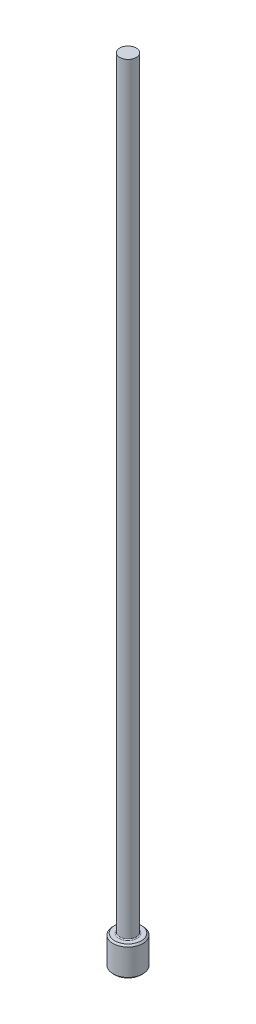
ISO-10303-21;
HEADER;
FILE_DESCRIPTION(('STEP AP214'),'2;1');
FILE_NAME('part.step','',(''),(''),'','','');
FILE_SCHEMA(('AUTOMOTIVE_DESIGN { 1 0 10303 214 1 1 1 1 }'));
ENDSEC;
DATA;
#1=APPLICATION_CONTEXT('core data for automotive mechanical design processes');
#2=APPLICATION_PROTOCOL_DEFINITION('international standard','automotive_design',2000,#1);
#3=PRODUCT_CONTEXT('',#1,'mechanical');
#4=PRODUCT('Part','Part','',(#3));
#5=PRODUCT_RELATED_PRODUCT_CATEGORY('part','',(#4));
#6=PRODUCT_DEFINITION_FORMATION('','',#4);
#7=PRODUCT_DEFINITION_CONTEXT('part definition',#1,'design');
#8=PRODUCT_DEFINITION('design','',#6,#7);
#9=PRODUCT_DEFINITION_SHAPE('','',#8);
#10=(LENGTH_UNIT() NAMED_UNIT(*) SI_UNIT(.MILLI.,.METRE.));
#11=(NAMED_UNIT(*) PLANE_ANGLE_UNIT() SI_UNIT($,.RADIAN.));
#12=(NAMED_UNIT(*) SI_UNIT($,.STERADIAN.) SOLID_ANGLE_UNIT());
#13=UNCERTAINTY_MEASURE_WITH_UNIT(LENGTH_MEASURE(1.E-05),#10,'distance_accuracy_value','');
#14=(GEOMETRIC_REPRESENTATION_CONTEXT(3) GLOBAL_UNCERTAINTY_ASSIGNED_CONTEXT((#13)) GLOBAL_UNIT_ASSIGNED_CONTEXT((#10,
#11,#12)) REPRESENTATION_CONTEXT('',''));
#15=CARTESIAN_POINT('',(0.,0.,0.));
#16=DIRECTION('',(0.,0.,1.));
#17=DIRECTION('',(1.,0.,0.));
#18=AXIS2_PLACEMENT_3D('',#15,#16,#17);
#19=CARTESIAN_POINT('',(0.,0.,0.));
#20=DIRECTION('',(0.,-1.,0.));
#21=DIRECTION('',(0.,0.,-1.));
#22=AXIS2_PLACEMENT_3D('',#19,#20,#21);
#23=PLANE('',#22);
#24=CARTESIAN_POINT('',(0.,0.,0.));
#25=DIRECTION('',(0.,-1.,0.));
#26=DIRECTION('',(0.,0.,-1.));
#27=AXIS2_PLACEMENT_3D('',#24,#25,#26);
#28=CIRCLE('',#27,1.06679999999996);
#29=CARTESIAN_POINT('',(0.,0.,-1.06679999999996));
#30=VERTEX_POINT('',#29);
#31=EDGE_CURVE('E46',#30,#30,#28,.T.);
#32=ORIENTED_EDGE('',*,*,#31,.T.);
#33=EDGE_LOOP('',(#32));
#34=FACE_BOUND('',#33,.T.);
#35=ADVANCED_FACE('F35',(#34),#23,.T.);
#36=CARTESIAN_POINT('',(0.,259.958771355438,0.));
#37=DIRECTION('',(0.,1.,0.));
#38=DIRECTION('',(0.,0.,1.));
#39=AXIS2_PLACEMENT_3D('',#36,#37,#38);
#40=CYLINDRICAL_SURFACE('',#39,1.19379999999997);
#41=CARTESIAN_POINT('',(0.,2.23519999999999,0.));
#42=DIRECTION('',(0.,1.,0.));
#43=DIRECTION('',(0.,0.,1.));
#44=AXIS2_PLACEMENT_3D('',#41,#42,#43);
#45=CIRCLE('',#44,1.19379999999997);
#46=CARTESIAN_POINT('',(0.,2.23519999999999,1.19379999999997));
#47=VERTEX_POINT('',#46);
#48=EDGE_CURVE('E50',#47,#47,#45,.F.);
#49=ORIENTED_EDGE('',*,*,#48,.T.);
#50=EDGE_LOOP('',(#49));
#51=FACE_BOUND('',#50,.T.);
#52=CARTESIAN_POINT('',(0.,0.126999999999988,0.));
#53=DIRECTION('',(0.,-1.,0.));
#54=DIRECTION('',(0.,0.,-1.));
#55=AXIS2_PLACEMENT_3D('',#52,#53,#54);
#56=CIRCLE('',#55,1.19379999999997);
#57=CARTESIAN_POINT('',(0.,0.126999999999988,-1.19379999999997));
#58=VERTEX_POINT('',#57);
#59=EDGE_CURVE('E55',#58,#58,#56,.F.);
#60=ORIENTED_EDGE('',*,*,#59,.T.);
#61=EDGE_LOOP('',(#60));
#62=FACE_BOUND('',#61,.T.);
#63=ADVANCED_FACE('F77',(#51,#62),#40,.T.);
#64=CARTESIAN_POINT('',(-1.19379999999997,2.3622,0.));
#65=DIRECTION('',(0.,1.,0.));
#66=DIRECTION('',(0.,0.,1.));
#67=AXIS2_PLACEMENT_3D('',#64,#65,#66);
#68=PLANE('',#67);
#69=CARTESIAN_POINT('',(0.,2.3622,0.));
#70=DIRECTION('',(0.,1.,0.));
#71=DIRECTION('',(0.,0.,1.));
#72=AXIS2_PLACEMENT_3D('',#69,#70,#71);
#73=CIRCLE('',#72,0.736599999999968);
#74=CARTESIAN_POINT('',(0.,2.3622,0.736599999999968));
#75=VERTEX_POINT('',#74);
#76=EDGE_CURVE('E10',#75,#75,#73,.F.);
#77=ORIENTED_EDGE('',*,*,#76,.T.);
#78=EDGE_LOOP('',(#77));
#79=FACE_BOUND('',#78,.T.);
#80=CARTESIAN_POINT('',(0.,2.3622,0.));
#81=DIRECTION('',(0.,1.,0.));
#82=DIRECTION('',(0.,0.,1.));
#83=AXIS2_PLACEMENT_3D('',#80,#81,#82);
#84=CIRCLE('',#83,1.06679999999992);
#85=CARTESIAN_POINT('',(0.,2.3622,1.06679999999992));
#86=VERTEX_POINT('',#85);
#87=EDGE_CURVE('E58',#86,#86,#84,.T.);
#88=ORIENTED_EDGE('',*,*,#87,.T.);
#89=EDGE_LOOP('',(#88));
#90=FACE_BOUND('',#89,.T.);
#91=ADVANCED_FACE('F69',(#79,#90),#68,.T.);
#92=CARTESIAN_POINT('',(0.,259.958771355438,0.));
#93=DIRECTION('',(0.,1.,0.));
#94=DIRECTION('',(0.,0.,1.));
#95=AXIS2_PLACEMENT_3D('',#92,#93,#94);
#96=CYLINDRICAL_SURFACE('',#95,0.660399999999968);
#97=CARTESIAN_POINT('',(0.,2.43840000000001,0.));
#98=DIRECTION('',(0.,1.,0.));
#99=DIRECTION('',(0.,0.,1.));
#100=AXIS2_PLACEMENT_3D('',#97,#98,#99);
#101=CIRCLE('',#100,0.660399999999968);
#102=CARTESIAN_POINT('',(0.,2.43840000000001,0.660399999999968));
#103=VERTEX_POINT('',#102);
#104=EDGE_CURVE('E42',#103,#103,#101,.T.);
#105=ORIENTED_EDGE('',*,*,#104,.T.);
#106=EDGE_LOOP('',(#105));
#107=FACE_BOUND('',#106,.T.);
#108=CARTESIAN_POINT('',(0.,63.5,0.));
#109=DIRECTION('',(0.,1.,0.));
#110=DIRECTION('',(0.,0.,1.));
#111=AXIS2_PLACEMENT_3D('',#108,#109,#110);
#112=CIRCLE('',#111,0.660399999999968);
#113=CARTESIAN_POINT('',(0.,63.5,0.660399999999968));
#114=VERTEX_POINT('',#113);
#115=EDGE_CURVE('E61',#114,#114,#112,.T.);
#116=ORIENTED_EDGE('',*,*,#115,.F.);
#117=EDGE_LOOP('',(#116));
#118=FACE_BOUND('',#117,.T.);
#119=ADVANCED_FACE('F67',(#107,#118),#96,.T.);
#120=CARTESIAN_POINT('',(-0.660399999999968,63.5,0.));
#121=DIRECTION('',(0.,1.,0.));
#122=DIRECTION('',(0.,0.,1.));
#123=AXIS2_PLACEMENT_3D('',#120,#121,#122);
#124=PLANE('',#123);
#125=ORIENTED_EDGE('',*,*,#115,.T.);
#126=EDGE_LOOP('',(#125));
#127=FACE_BOUND('',#126,.T.);
#128=ADVANCED_FACE('F65',(#127),#124,.T.);
#129=CARTESIAN_POINT('',(0.,2.36219999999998,0.));
#130=DIRECTION('',(0.,-1.,0.));
#131=DIRECTION('',(0.,0.,-1.));
#132=AXIS2_PLACEMENT_3D('',#129,#130,#131);
#133=CONICAL_SURFACE('',#132,1.06679999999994,0.785398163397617);
#134=ORIENTED_EDGE('',*,*,#48,.F.);
#135=EDGE_LOOP('',(#134));
#136=FACE_BOUND('',#135,.T.);
#137=ORIENTED_EDGE('',*,*,#87,.F.);
#138=EDGE_LOOP('',(#137));
#139=FACE_BOUND('',#138,.T.);
#140=ADVANCED_FACE('F75',(#136,#139),#133,.T.);
#141=CARTESIAN_POINT('',(0.,0.126999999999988,0.));
#142=DIRECTION('',(0.,1.,0.));
#143=DIRECTION('',(0.,0.,1.));
#144=AXIS2_PLACEMENT_3D('',#141,#142,#143);
#145=CONICAL_SURFACE('',#144,1.19379999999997,0.785398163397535);
#146=ORIENTED_EDGE('',*,*,#31,.F.);
#147=EDGE_LOOP('',(#146));
#148=FACE_BOUND('',#147,.T.);
#149=ORIENTED_EDGE('',*,*,#59,.F.);
#150=EDGE_LOOP('',(#149));
#151=FACE_BOUND('',#150,.T.);
#152=ADVANCED_FACE('F89',(#148,#151),#145,.T.);
#153=CARTESIAN_POINT('',(0.,2.43840000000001,0.));
#154=DIRECTION('',(0.,1.,0.));
#155=DIRECTION('',(0.,0.,1.));
#156=AXIS2_PLACEMENT_3D('',#153,#154,#155);
#157=TOROIDAL_SURFACE('',#156,0.736599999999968,0.0762);
#158=ORIENTED_EDGE('',*,*,#76,.F.);
#159=EDGE_LOOP('',(#158));
#160=FACE_BOUND('',#159,.T.);
#161=ORIENTED_EDGE('',*,*,#104,.F.);
#162=EDGE_LOOP('',(#161));
#163=FACE_BOUND('',#162,.T.);
#164=ADVANCED_FACE('F37',(#160,#163),#157,.F.);
#165=CLOSED_SHELL('',(#35,#63,#91,#119,#128,#140,#152,#164));
#166=MANIFOLD_SOLID_BREP('B2',#165);
#167=ADVANCED_BREP_SHAPE_REPRESENTATION('',(#18,#166),#14);
#168=SHAPE_DEFINITION_REPRESENTATION(#9,#167);
ENDSEC;
END-ISO-10303-21;
